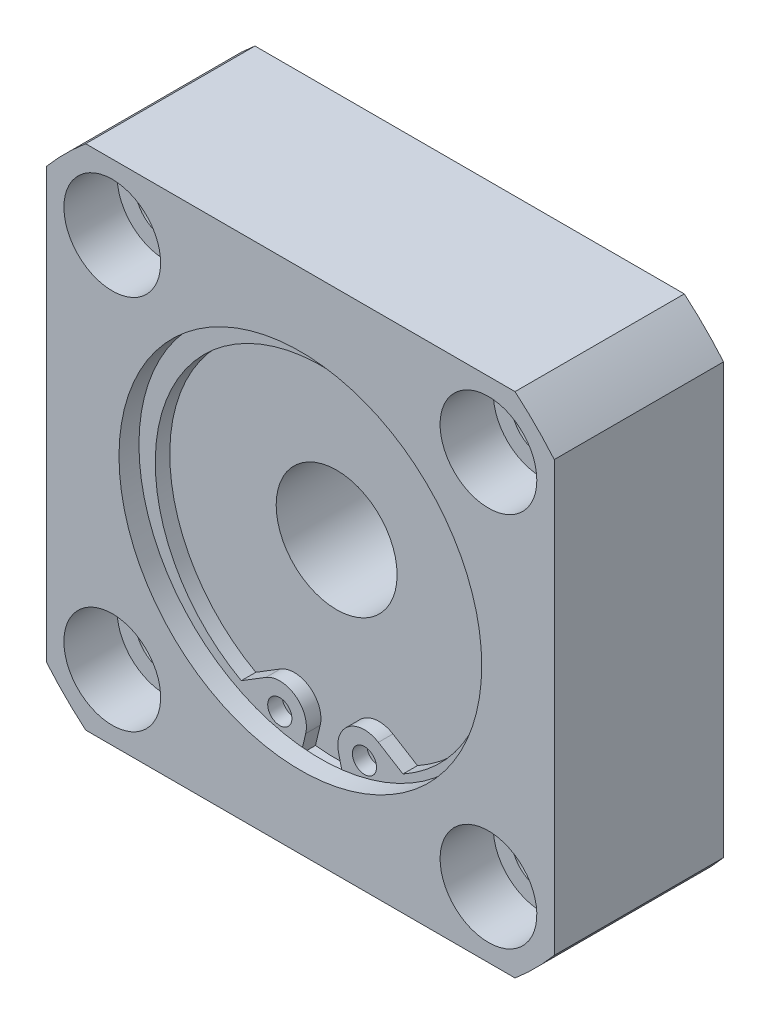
ISO-10303-21;
HEADER;
FILE_DESCRIPTION(('STEP AP214'),'2;1');
FILE_NAME('part.step','',(''),(''),'','','');
FILE_SCHEMA(('AUTOMOTIVE_DESIGN { 1 0 10303 214 1 1 1 1 }'));
ENDSEC;
DATA;
#1=APPLICATION_CONTEXT('core data for automotive mechanical design processes');
#2=APPLICATION_PROTOCOL_DEFINITION('international standard','automotive_design',2000,#1);
#3=PRODUCT_CONTEXT('',#1,'mechanical');
#4=PRODUCT('Part','Part','',(#3));
#5=PRODUCT_RELATED_PRODUCT_CATEGORY('part','',(#4));
#6=PRODUCT_DEFINITION_FORMATION('','',#4);
#7=PRODUCT_DEFINITION_CONTEXT('part definition',#1,'design');
#8=PRODUCT_DEFINITION('design','',#6,#7);
#9=PRODUCT_DEFINITION_SHAPE('','',#8);
#10=(LENGTH_UNIT() NAMED_UNIT(*) SI_UNIT(.MILLI.,.METRE.));
#11=(NAMED_UNIT(*) PLANE_ANGLE_UNIT() SI_UNIT($,.RADIAN.));
#12=(NAMED_UNIT(*) SI_UNIT($,.STERADIAN.) SOLID_ANGLE_UNIT());
#13=UNCERTAINTY_MEASURE_WITH_UNIT(LENGTH_MEASURE(1.E-05),#10,'distance_accuracy_value','');
#14=(GEOMETRIC_REPRESENTATION_CONTEXT(3) GLOBAL_UNCERTAINTY_ASSIGNED_CONTEXT((#13)) GLOBAL_UNIT_ASSIGNED_CONTEXT((#10,
#11,#12)) REPRESENTATION_CONTEXT('',''));
#15=CARTESIAN_POINT('',(0.,0.,0.));
#16=DIRECTION('',(0.,0.,1.));
#17=DIRECTION('',(1.,0.,0.));
#18=AXIS2_PLACEMENT_3D('',#15,#16,#17);
#19=CARTESIAN_POINT('',(15.556349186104,15.5563491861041,0.));
#20=DIRECTION('',(0.,0.,1.));
#21=DIRECTION('',(1.,0.,0.));
#22=AXIS2_PLACEMENT_3D('',#19,#20,#21);
#23=CYLINDRICAL_SURFACE('',#22,2.5);
#24=CARTESIAN_POINT('',(15.556349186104,15.5563491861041,0.));
#25=DIRECTION('',(0.,0.,1.));
#26=DIRECTION('',(1.,0.,0.));
#27=AXIS2_PLACEMENT_3D('',#24,#25,#26);
#28=CIRCLE('',#27,2.5);
#29=CARTESIAN_POINT('',(18.056349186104,15.5563491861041,0.));
#30=VERTEX_POINT('',#29);
#31=EDGE_CURVE('E210',#30,#30,#28,.T.);
#32=ORIENTED_EDGE('',*,*,#31,.F.);
#33=EDGE_LOOP('',(#32));
#34=FACE_BOUND('',#33,.T.);
#35=CARTESIAN_POINT('',(15.556349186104,15.5563491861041,9.6));
#36=DIRECTION('',(0.,0.,1.));
#37=DIRECTION('',(1.,0.,0.));
#38=AXIS2_PLACEMENT_3D('',#35,#36,#37);
#39=CIRCLE('',#38,2.5);
#40=CARTESIAN_POINT('',(18.056349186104,15.5563491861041,9.6));
#41=VERTEX_POINT('',#40);
#42=EDGE_CURVE('E207',#41,#41,#39,.F.);
#43=ORIENTED_EDGE('',*,*,#42,.F.);
#44=EDGE_LOOP('',(#43));
#45=FACE_BOUND('',#44,.T.);
#46=ADVANCED_FACE('F14',(#34,#45),#23,.F.);
#47=CARTESIAN_POINT('',(15.556349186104,-15.556349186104,0.));
#48=DIRECTION('',(0.,0.,1.));
#49=DIRECTION('',(1.,0.,0.));
#50=AXIS2_PLACEMENT_3D('',#47,#48,#49);
#51=CYLINDRICAL_SURFACE('',#50,2.5);
#52=CARTESIAN_POINT('',(15.556349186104,-15.556349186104,0.));
#53=DIRECTION('',(0.,0.,1.));
#54=DIRECTION('',(0.,-1.,0.));
#55=AXIS2_PLACEMENT_3D('',#52,#53,#54);
#56=CIRCLE('',#55,2.5);
#57=CARTESIAN_POINT('',(15.556349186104,-18.056349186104,0.));
#58=VERTEX_POINT('',#57);
#59=EDGE_CURVE('E290',#58,#58,#56,.T.);
#60=ORIENTED_EDGE('',*,*,#59,.F.);
#61=EDGE_LOOP('',(#60));
#62=FACE_BOUND('',#61,.T.);
#63=CARTESIAN_POINT('',(15.556349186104,-15.556349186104,9.6));
#64=DIRECTION('',(0.,0.,1.));
#65=DIRECTION('',(1.,0.,0.));
#66=AXIS2_PLACEMENT_3D('',#63,#64,#65);
#67=CIRCLE('',#66,2.5);
#68=CARTESIAN_POINT('',(18.056349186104,-15.556349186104,9.6));
#69=VERTEX_POINT('',#68);
#70=EDGE_CURVE('E202',#69,#69,#67,.F.);
#71=ORIENTED_EDGE('',*,*,#70,.F.);
#72=EDGE_LOOP('',(#71));
#73=FACE_BOUND('',#72,.T.);
#74=ADVANCED_FACE('F429',(#62,#73),#51,.F.);
#75=CARTESIAN_POINT('',(-15.5563491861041,-15.556349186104,0.));
#76=DIRECTION('',(0.,0.,1.));
#77=DIRECTION('',(1.,0.,0.));
#78=AXIS2_PLACEMENT_3D('',#75,#76,#77);
#79=CYLINDRICAL_SURFACE('',#78,2.5);
#80=CARTESIAN_POINT('',(-15.5563491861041,-15.556349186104,0.));
#81=DIRECTION('',(0.,0.,1.));
#82=DIRECTION('',(-1.,0.,0.));
#83=AXIS2_PLACEMENT_3D('',#80,#81,#82);
#84=CIRCLE('',#83,2.5);
#85=CARTESIAN_POINT('',(-18.0563491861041,-15.556349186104,0.));
#86=VERTEX_POINT('',#85);
#87=EDGE_CURVE('E293',#86,#86,#84,.T.);
#88=ORIENTED_EDGE('',*,*,#87,.F.);
#89=EDGE_LOOP('',(#88));
#90=FACE_BOUND('',#89,.T.);
#91=CARTESIAN_POINT('',(-15.5563491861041,-15.556349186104,9.6));
#92=DIRECTION('',(0.,0.,1.));
#93=DIRECTION('',(1.,0.,0.));
#94=AXIS2_PLACEMENT_3D('',#91,#92,#93);
#95=CIRCLE('',#94,2.5);
#96=CARTESIAN_POINT('',(-13.0563491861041,-15.556349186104,9.6));
#97=VERTEX_POINT('',#96);
#98=EDGE_CURVE('E197',#97,#97,#95,.F.);
#99=ORIENTED_EDGE('',*,*,#98,.F.);
#100=EDGE_LOOP('',(#99));
#101=FACE_BOUND('',#100,.T.);
#102=ADVANCED_FACE('F435',(#90,#101),#79,.F.);
#103=CARTESIAN_POINT('',(-15.556349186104,15.5563491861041,0.));
#104=DIRECTION('',(0.,0.,1.));
#105=DIRECTION('',(1.,0.,0.));
#106=AXIS2_PLACEMENT_3D('',#103,#104,#105);
#107=CYLINDRICAL_SURFACE('',#106,2.5);
#108=CARTESIAN_POINT('',(-15.556349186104,15.5563491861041,0.));
#109=DIRECTION('',(0.,0.,1.));
#110=DIRECTION('',(0.,1.,0.));
#111=AXIS2_PLACEMENT_3D('',#108,#109,#110);
#112=CIRCLE('',#111,2.5);
#113=CARTESIAN_POINT('',(-15.5563491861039,18.0563491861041,0.));
#114=VERTEX_POINT('',#113);
#115=EDGE_CURVE('E205',#114,#114,#112,.T.);
#116=ORIENTED_EDGE('',*,*,#115,.F.);
#117=EDGE_LOOP('',(#116));
#118=FACE_BOUND('',#117,.T.);
#119=CARTESIAN_POINT('',(-15.556349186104,15.5563491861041,9.6));
#120=DIRECTION('',(0.,0.,1.));
#121=DIRECTION('',(1.,0.,0.));
#122=AXIS2_PLACEMENT_3D('',#119,#120,#121);
#123=CIRCLE('',#122,2.5);
#124=CARTESIAN_POINT('',(-13.056349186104,15.5563491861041,9.6));
#125=VERTEX_POINT('',#124);
#126=EDGE_CURVE('E192',#125,#125,#123,.F.);
#127=ORIENTED_EDGE('',*,*,#126,.F.);
#128=EDGE_LOOP('',(#127));
#129=FACE_BOUND('',#128,.T.);
#130=ADVANCED_FACE('F539',(#118,#129),#107,.F.);
#131=CARTESIAN_POINT('',(15.556349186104,15.5563491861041,9.6));
#132=DIRECTION('',(0.,0.,1.));
#133=DIRECTION('',(1.,0.,0.));
#134=AXIS2_PLACEMENT_3D('',#131,#132,#133);
#135=PLANE('',#134);
#136=CARTESIAN_POINT('',(15.556349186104,15.5563491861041,9.6));
#137=DIRECTION('',(0.,0.,1.));
#138=DIRECTION('',(1.,0.,0.));
#139=AXIS2_PLACEMENT_3D('',#136,#137,#138);
#140=CIRCLE('',#139,4.);
#141=CARTESIAN_POINT('',(19.556349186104,15.5563491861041,9.6));
#142=VERTEX_POINT('',#141);
#143=EDGE_CURVE('E211',#142,#142,#140,.T.);
#144=ORIENTED_EDGE('',*,*,#143,.T.);
#145=EDGE_LOOP('',(#144));
#146=FACE_BOUND('',#145,.T.);
#147=ORIENTED_EDGE('',*,*,#42,.T.);
#148=EDGE_LOOP('',(#147));
#149=FACE_BOUND('',#148,.T.);
#150=ADVANCED_FACE('F534',(#146,#149),#135,.T.);
#151=CARTESIAN_POINT('',(15.556349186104,-15.556349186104,9.6));
#152=DIRECTION('',(0.,0.,1.));
#153=DIRECTION('',(0.,-1.,0.));
#154=AXIS2_PLACEMENT_3D('',#151,#152,#153);
#155=PLANE('',#154);
#156=CARTESIAN_POINT('',(15.556349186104,-15.556349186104,9.6));
#157=DIRECTION('',(0.,0.,1.));
#158=DIRECTION('',(0.,-1.,0.));
#159=AXIS2_PLACEMENT_3D('',#156,#157,#158);
#160=CIRCLE('',#159,4.);
#161=CARTESIAN_POINT('',(15.556349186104,-19.556349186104,9.6));
#162=VERTEX_POINT('',#161);
#163=EDGE_CURVE('E206',#162,#162,#160,.T.);
#164=ORIENTED_EDGE('',*,*,#163,.T.);
#165=EDGE_LOOP('',(#164));
#166=FACE_BOUND('',#165,.T.);
#167=ORIENTED_EDGE('',*,*,#70,.T.);
#168=EDGE_LOOP('',(#167));
#169=FACE_BOUND('',#168,.T.);
#170=ADVANCED_FACE('F526',(#166,#169),#155,.T.);
#171=CARTESIAN_POINT('',(-15.5563491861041,-15.556349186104,9.6));
#172=DIRECTION('',(0.,0.,1.));
#173=DIRECTION('',(-1.,0.,0.));
#174=AXIS2_PLACEMENT_3D('',#171,#172,#173);
#175=PLANE('',#174);
#176=CARTESIAN_POINT('',(-15.5563491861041,-15.556349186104,9.6));
#177=DIRECTION('',(0.,0.,1.));
#178=DIRECTION('',(-1.,0.,0.));
#179=AXIS2_PLACEMENT_3D('',#176,#177,#178);
#180=CIRCLE('',#179,4.);
#181=CARTESIAN_POINT('',(-19.5563491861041,-15.556349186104,9.6));
#182=VERTEX_POINT('',#181);
#183=EDGE_CURVE('E201',#182,#182,#180,.T.);
#184=ORIENTED_EDGE('',*,*,#183,.T.);
#185=EDGE_LOOP('',(#184));
#186=FACE_BOUND('',#185,.T.);
#187=ORIENTED_EDGE('',*,*,#98,.T.);
#188=EDGE_LOOP('',(#187));
#189=FACE_BOUND('',#188,.T.);
#190=ADVANCED_FACE('F518',(#186,#189),#175,.T.);
#191=CARTESIAN_POINT('',(-15.556349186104,15.5563491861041,9.6));
#192=DIRECTION('',(0.,0.,1.));
#193=DIRECTION('',(0.,1.,0.));
#194=AXIS2_PLACEMENT_3D('',#191,#192,#193);
#195=PLANE('',#194);
#196=CARTESIAN_POINT('',(-15.556349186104,15.5563491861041,9.6));
#197=DIRECTION('',(0.,0.,1.));
#198=DIRECTION('',(0.,1.,0.));
#199=AXIS2_PLACEMENT_3D('',#196,#197,#198);
#200=CIRCLE('',#199,4.);
#201=CARTESIAN_POINT('',(-15.5563491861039,19.5563491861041,9.6));
#202=VERTEX_POINT('',#201);
#203=EDGE_CURVE('E196',#202,#202,#200,.T.);
#204=ORIENTED_EDGE('',*,*,#203,.T.);
#205=EDGE_LOOP('',(#204));
#206=FACE_BOUND('',#205,.T.);
#207=ORIENTED_EDGE('',*,*,#126,.T.);
#208=EDGE_LOOP('',(#207));
#209=FACE_BOUND('',#208,.T.);
#210=ADVANCED_FACE('F450',(#206,#209),#195,.T.);
#211=CARTESIAN_POINT('',(0.,0.,0.));
#212=DIRECTION('',(0.,0.,-1.));
#213=DIRECTION('',(-1.,0.,0.));
#214=AXIS2_PLACEMENT_3D('',#211,#212,#213);
#215=PLANE('',#214);
#216=CARTESIAN_POINT('',(0.,0.,0.));
#217=DIRECTION('',(0.,0.,-1.));
#218=DIRECTION('',(-1.,0.,0.));
#219=AXIS2_PLACEMENT_3D('',#216,#217,#218);
#220=CIRCLE('',#219,12.);
#221=CARTESIAN_POINT('',(-12.,0.,0.));
#222=VERTEX_POINT('',#221);
#223=EDGE_CURVE('E181',#222,#222,#220,.T.);
#224=ORIENTED_EDGE('',*,*,#223,.F.);
#225=EDGE_LOOP('',(#224));
#226=FACE_BOUND('',#225,.T.);
#227=ORIENTED_EDGE('',*,*,#115,.T.);
#228=EDGE_LOOP('',(#227));
#229=FACE_BOUND('',#228,.T.);
#230=ORIENTED_EDGE('',*,*,#87,.T.);
#231=EDGE_LOOP('',(#230));
#232=FACE_BOUND('',#231,.T.);
#233=ORIENTED_EDGE('',*,*,#59,.T.);
#234=EDGE_LOOP('',(#233));
#235=FACE_BOUND('',#234,.T.);
#236=ORIENTED_EDGE('',*,*,#31,.T.);
#237=EDGE_LOOP('',(#236));
#238=FACE_BOUND('',#237,.T.);
#239=CARTESIAN_POINT('',(0.,0.,0.));
#240=DIRECTION('',(0.,0.,-1.));
#241=DIRECTION('',(-1.,0.,0.));
#242=AXIS2_PLACEMENT_3D('',#239,#240,#241);
#243=CIRCLE('',#242,27.5);
#244=CARTESIAN_POINT('',(21.,-17.7552809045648,0.));
#245=VERTEX_POINT('',#244);
#246=CARTESIAN_POINT('',(17.7552809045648,-21.,0.));
#247=VERTEX_POINT('',#246);
#248=EDGE_CURVE('E280',#245,#247,#243,.T.);
#249=ORIENTED_EDGE('',*,*,#248,.T.);
#250=DIRECTION('',(1.,0.,0.));
#251=VECTOR('',#250,1.);
#252=CARTESIAN_POINT('',(-17.7552809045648,-21.,0.));
#253=LINE('',#252,#251);
#254=CARTESIAN_POINT('',(-17.7552809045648,-21.,0.));
#255=VERTEX_POINT('',#254);
#256=EDGE_CURVE('E277',#255,#247,#253,.T.);
#257=ORIENTED_EDGE('',*,*,#256,.F.);
#258=CARTESIAN_POINT('',(0.,0.,0.));
#259=DIRECTION('',(0.,0.,1.));
#260=DIRECTION('',(1.,0.,0.));
#261=AXIS2_PLACEMENT_3D('',#258,#259,#260);
#262=CIRCLE('',#261,27.5);
#263=CARTESIAN_POINT('',(-21.,-17.7552809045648,0.));
#264=VERTEX_POINT('',#263);
#265=EDGE_CURVE('E274',#264,#255,#262,.T.);
#266=ORIENTED_EDGE('',*,*,#265,.F.);
#267=DIRECTION('',(0.,1.,0.));
#268=VECTOR('',#267,1.);
#269=CARTESIAN_POINT('',(-21.,-17.7552809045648,0.));
#270=LINE('',#269,#268);
#271=CARTESIAN_POINT('',(-21.,17.7552809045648,0.));
#272=VERTEX_POINT('',#271);
#273=EDGE_CURVE('E271',#264,#272,#270,.T.);
#274=ORIENTED_EDGE('',*,*,#273,.T.);
#275=CARTESIAN_POINT('',(0.,0.,0.));
#276=DIRECTION('',(0.,0.,-1.));
#277=DIRECTION('',(-1.,0.,0.));
#278=AXIS2_PLACEMENT_3D('',#275,#276,#277);
#279=CIRCLE('',#278,27.5);
#280=CARTESIAN_POINT('',(-17.7552809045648,21.,0.));
#281=VERTEX_POINT('',#280);
#282=EDGE_CURVE('E268',#272,#281,#279,.T.);
#283=ORIENTED_EDGE('',*,*,#282,.T.);
#284=DIRECTION('',(1.,0.,0.));
#285=VECTOR('',#284,1.);
#286=CARTESIAN_POINT('',(-17.7552809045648,21.,0.));
#287=LINE('',#286,#285);
#288=CARTESIAN_POINT('',(17.7552809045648,21.,0.));
#289=VERTEX_POINT('',#288);
#290=EDGE_CURVE('E265',#281,#289,#287,.T.);
#291=ORIENTED_EDGE('',*,*,#290,.T.);
#292=CARTESIAN_POINT('',(0.,0.,0.));
#293=DIRECTION('',(0.,0.,1.));
#294=DIRECTION('',(1.,0.,0.));
#295=AXIS2_PLACEMENT_3D('',#292,#293,#294);
#296=CIRCLE('',#295,27.5);
#297=CARTESIAN_POINT('',(21.,17.7552809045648,0.));
#298=VERTEX_POINT('',#297);
#299=EDGE_CURVE('E262',#298,#289,#296,.T.);
#300=ORIENTED_EDGE('',*,*,#299,.F.);
#301=DIRECTION('',(0.,1.,0.));
#302=VECTOR('',#301,1.);
#303=CARTESIAN_POINT('',(21.,-17.7552809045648,0.));
#304=LINE('',#303,#302);
#305=EDGE_CURVE('E259',#245,#298,#304,.T.);
#306=ORIENTED_EDGE('',*,*,#305,.F.);
#307=EDGE_LOOP('',(#249,#257,#266,#274,#283,#291,#300,#306));
#308=FACE_BOUND('',#307,.T.);
#309=ADVANCED_FACE('F447',(#226,#229,#232,#235,#238,#308),#215,.T.);
#310=CARTESIAN_POINT('',(-17.7552809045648,-21.,14.));
#311=DIRECTION('',(0.,1.,0.));
#312=DIRECTION('',(0.,0.,1.));
#313=AXIS2_PLACEMENT_3D('',#310,#311,#312);
#314=PLANE('',#313);
#315=DIRECTION('',(1.,0.,0.));
#316=VECTOR('',#315,1.);
#317=CARTESIAN_POINT('',(-17.7552809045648,-21.,14.));
#318=LINE('',#317,#316);
#319=CARTESIAN_POINT('',(-17.7552809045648,-21.,14.));
#320=VERTEX_POINT('',#319);
#321=CARTESIAN_POINT('',(17.7552809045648,-21.,14.));
#322=VERTEX_POINT('',#321);
#323=EDGE_CURVE('E253',#320,#322,#318,.T.);
#324=ORIENTED_EDGE('',*,*,#323,.F.);
#325=DIRECTION('',(0.,0.,-1.));
#326=VECTOR('',#325,1.);
#327=CARTESIAN_POINT('',(-17.7552809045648,-21.,14.));
#328=LINE('',#327,#326);
#329=EDGE_CURVE('E229',#320,#255,#328,.T.);
#330=ORIENTED_EDGE('',*,*,#329,.T.);
#331=ORIENTED_EDGE('',*,*,#256,.T.);
#332=DIRECTION('',(0.,0.,-1.));
#333=VECTOR('',#332,1.);
#334=CARTESIAN_POINT('',(17.7552809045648,-21.,14.));
#335=LINE('',#334,#333);
#336=EDGE_CURVE('E232',#322,#247,#335,.T.);
#337=ORIENTED_EDGE('',*,*,#336,.F.);
#338=EDGE_LOOP('',(#324,#330,#331,#337));
#339=FACE_BOUND('',#338,.T.);
#340=ADVANCED_FACE('F449',(#339),#314,.F.);
#341=CARTESIAN_POINT('',(0.,0.,14.));
#342=DIRECTION('',(0.,0.,-1.));
#343=DIRECTION('',(-1.,0.,0.));
#344=AXIS2_PLACEMENT_3D('',#341,#342,#343);
#345=CYLINDRICAL_SURFACE('',#344,27.5);
#346=ORIENTED_EDGE('',*,*,#329,.F.);
#347=CARTESIAN_POINT('',(0.,0.,14.));
#348=DIRECTION('',(0.,0.,1.));
#349=DIRECTION('',(1.,0.,0.));
#350=AXIS2_PLACEMENT_3D('',#347,#348,#349);
#351=CIRCLE('',#350,27.5);
#352=CARTESIAN_POINT('',(-21.,-17.7552809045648,14.));
#353=VERTEX_POINT('',#352);
#354=EDGE_CURVE('E250',#353,#320,#351,.T.);
#355=ORIENTED_EDGE('',*,*,#354,.F.);
#356=DIRECTION('',(0.,0.,-1.));
#357=VECTOR('',#356,1.);
#358=CARTESIAN_POINT('',(-21.,-17.7552809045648,14.));
#359=LINE('',#358,#357);
#360=EDGE_CURVE('E226',#353,#264,#359,.T.);
#361=ORIENTED_EDGE('',*,*,#360,.T.);
#362=ORIENTED_EDGE('',*,*,#265,.T.);
#363=EDGE_LOOP('',(#346,#355,#361,#362));
#364=FACE_BOUND('',#363,.T.);
#365=ADVANCED_FACE('F458',(#364),#345,.T.);
#366=CARTESIAN_POINT('',(-21.,-17.7552809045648,14.));
#367=DIRECTION('',(-1.,0.,0.));
#368=DIRECTION('',(0.,0.,1.));
#369=AXIS2_PLACEMENT_3D('',#366,#367,#368);
#370=PLANE('',#369);
#371=ORIENTED_EDGE('',*,*,#360,.F.);
#372=DIRECTION('',(0.,1.,0.));
#373=VECTOR('',#372,1.);
#374=CARTESIAN_POINT('',(-21.,-17.7552809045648,14.));
#375=LINE('',#374,#373);
#376=CARTESIAN_POINT('',(-21.,17.7552809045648,14.));
#377=VERTEX_POINT('',#376);
#378=EDGE_CURVE('E247',#353,#377,#375,.T.);
#379=ORIENTED_EDGE('',*,*,#378,.T.);
#380=DIRECTION('',(0.,0.,-1.));
#381=VECTOR('',#380,1.);
#382=CARTESIAN_POINT('',(-21.,17.7552809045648,14.));
#383=LINE('',#382,#381);
#384=EDGE_CURVE('E223',#377,#272,#383,.T.);
#385=ORIENTED_EDGE('',*,*,#384,.T.);
#386=ORIENTED_EDGE('',*,*,#273,.F.);
#387=EDGE_LOOP('',(#371,#379,#385,#386));
#388=FACE_BOUND('',#387,.T.);
#389=ADVANCED_FACE('F462',(#388),#370,.T.);
#390=CARTESIAN_POINT('',(0.,0.,14.));
#391=DIRECTION('',(0.,0.,-1.));
#392=DIRECTION('',(-1.,0.,0.));
#393=AXIS2_PLACEMENT_3D('',#390,#391,#392);
#394=CYLINDRICAL_SURFACE('',#393,27.5);
#395=ORIENTED_EDGE('',*,*,#384,.F.);
#396=CARTESIAN_POINT('',(0.,0.,14.));
#397=DIRECTION('',(0.,0.,-1.));
#398=DIRECTION('',(-1.,0.,0.));
#399=AXIS2_PLACEMENT_3D('',#396,#397,#398);
#400=CIRCLE('',#399,27.5);
#401=CARTESIAN_POINT('',(-17.7552809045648,21.,14.));
#402=VERTEX_POINT('',#401);
#403=EDGE_CURVE('E244',#377,#402,#400,.T.);
#404=ORIENTED_EDGE('',*,*,#403,.T.);
#405=DIRECTION('',(0.,0.,-1.));
#406=VECTOR('',#405,1.);
#407=CARTESIAN_POINT('',(-17.7552809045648,21.,14.));
#408=LINE('',#407,#406);
#409=EDGE_CURVE('E220',#402,#281,#408,.T.);
#410=ORIENTED_EDGE('',*,*,#409,.T.);
#411=ORIENTED_EDGE('',*,*,#282,.F.);
#412=EDGE_LOOP('',(#395,#404,#410,#411));
#413=FACE_BOUND('',#412,.T.);
#414=ADVANCED_FACE('F466',(#413),#394,.T.);
#415=CARTESIAN_POINT('',(-17.7552809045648,21.,14.));
#416=DIRECTION('',(0.,1.,0.));
#417=DIRECTION('',(0.,0.,1.));
#418=AXIS2_PLACEMENT_3D('',#415,#416,#417);
#419=PLANE('',#418);
#420=ORIENTED_EDGE('',*,*,#409,.F.);
#421=DIRECTION('',(1.,0.,0.));
#422=VECTOR('',#421,1.);
#423=CARTESIAN_POINT('',(-17.7552809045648,21.,14.));
#424=LINE('',#423,#422);
#425=CARTESIAN_POINT('',(17.7552809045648,21.,14.));
#426=VERTEX_POINT('',#425);
#427=EDGE_CURVE('E241',#402,#426,#424,.T.);
#428=ORIENTED_EDGE('',*,*,#427,.T.);
#429=DIRECTION('',(0.,0.,-1.));
#430=VECTOR('',#429,1.);
#431=CARTESIAN_POINT('',(17.7552809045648,21.,14.));
#432=LINE('',#431,#430);
#433=EDGE_CURVE('E217',#426,#289,#432,.T.);
#434=ORIENTED_EDGE('',*,*,#433,.T.);
#435=ORIENTED_EDGE('',*,*,#290,.F.);
#436=EDGE_LOOP('',(#420,#428,#434,#435));
#437=FACE_BOUND('',#436,.T.);
#438=ADVANCED_FACE('F470',(#437),#419,.T.);
#439=CARTESIAN_POINT('',(0.,0.,14.));
#440=DIRECTION('',(0.,0.,-1.));
#441=DIRECTION('',(-1.,0.,0.));
#442=AXIS2_PLACEMENT_3D('',#439,#440,#441);
#443=CYLINDRICAL_SURFACE('',#442,27.5);
#444=ORIENTED_EDGE('',*,*,#433,.F.);
#445=CARTESIAN_POINT('',(0.,0.,14.));
#446=DIRECTION('',(0.,0.,1.));
#447=DIRECTION('',(1.,0.,0.));
#448=AXIS2_PLACEMENT_3D('',#445,#446,#447);
#449=CIRCLE('',#448,27.5);
#450=CARTESIAN_POINT('',(21.,17.7552809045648,14.));
#451=VERTEX_POINT('',#450);
#452=EDGE_CURVE('E238',#451,#426,#449,.T.);
#453=ORIENTED_EDGE('',*,*,#452,.F.);
#454=DIRECTION('',(0.,0.,-1.));
#455=VECTOR('',#454,1.);
#456=CARTESIAN_POINT('',(21.,17.7552809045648,14.));
#457=LINE('',#456,#455);
#458=EDGE_CURVE('E214',#451,#298,#457,.T.);
#459=ORIENTED_EDGE('',*,*,#458,.T.);
#460=ORIENTED_EDGE('',*,*,#299,.T.);
#461=EDGE_LOOP('',(#444,#453,#459,#460));
#462=FACE_BOUND('',#461,.T.);
#463=ADVANCED_FACE('F375',(#462),#443,.T.);
#464=CARTESIAN_POINT('',(21.,-17.7552809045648,14.));
#465=DIRECTION('',(-1.,0.,0.));
#466=DIRECTION('',(0.,0.,1.));
#467=AXIS2_PLACEMENT_3D('',#464,#465,#466);
#468=PLANE('',#467);
#469=ORIENTED_EDGE('',*,*,#458,.F.);
#470=DIRECTION('',(0.,1.,0.));
#471=VECTOR('',#470,1.);
#472=CARTESIAN_POINT('',(21.,-17.7552809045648,14.));
#473=LINE('',#472,#471);
#474=CARTESIAN_POINT('',(21.,-17.7552809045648,14.));
#475=VERTEX_POINT('',#474);
#476=EDGE_CURVE('E235',#475,#451,#473,.T.);
#477=ORIENTED_EDGE('',*,*,#476,.F.);
#478=DIRECTION('',(0.,0.,-1.));
#479=VECTOR('',#478,1.);
#480=CARTESIAN_POINT('',(21.,-17.7552809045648,14.));
#481=LINE('',#480,#479);
#482=EDGE_CURVE('E177',#475,#245,#481,.T.);
#483=ORIENTED_EDGE('',*,*,#482,.T.);
#484=ORIENTED_EDGE('',*,*,#305,.T.);
#485=EDGE_LOOP('',(#469,#477,#483,#484));
#486=FACE_BOUND('',#485,.T.);
#487=ADVANCED_FACE('F364',(#486),#468,.F.);
#488=CARTESIAN_POINT('',(0.,0.,14.));
#489=DIRECTION('',(0.,0.,-1.));
#490=DIRECTION('',(-1.,0.,0.));
#491=AXIS2_PLACEMENT_3D('',#488,#489,#490);
#492=CYLINDRICAL_SURFACE('',#491,27.5);
#493=ORIENTED_EDGE('',*,*,#482,.F.);
#494=CARTESIAN_POINT('',(0.,0.,14.));
#495=DIRECTION('',(0.,0.,-1.));
#496=DIRECTION('',(-1.,0.,0.));
#497=AXIS2_PLACEMENT_3D('',#494,#495,#496);
#498=CIRCLE('',#497,27.5);
#499=EDGE_CURVE('E256',#475,#322,#498,.T.);
#500=ORIENTED_EDGE('',*,*,#499,.T.);
#501=ORIENTED_EDGE('',*,*,#336,.T.);
#502=ORIENTED_EDGE('',*,*,#248,.F.);
#503=EDGE_LOOP('',(#493,#500,#501,#502));
#504=FACE_BOUND('',#503,.T.);
#505=ADVANCED_FACE('F453',(#504),#492,.T.);
#506=CARTESIAN_POINT('',(15.556349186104,15.5563491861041,9.6));
#507=DIRECTION('',(0.,0.,1.));
#508=DIRECTION('',(1.,0.,0.));
#509=AXIS2_PLACEMENT_3D('',#506,#507,#508);
#510=CYLINDRICAL_SURFACE('',#509,4.);
#511=ORIENTED_EDGE('',*,*,#143,.F.);
#512=EDGE_LOOP('',(#511));
#513=FACE_BOUND('',#512,.T.);
#514=CARTESIAN_POINT('',(15.556349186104,15.5563491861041,14.));
#515=DIRECTION('',(0.,0.,1.));
#516=DIRECTION('',(1.,0.,0.));
#517=AXIS2_PLACEMENT_3D('',#514,#515,#516);
#518=CIRCLE('',#517,4.);
#519=CARTESIAN_POINT('',(19.556349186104,15.5563491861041,14.));
#520=VERTEX_POINT('',#519);
#521=EDGE_CURVE('E287',#520,#520,#518,.T.);
#522=ORIENTED_EDGE('',*,*,#521,.T.);
#523=EDGE_LOOP('',(#522));
#524=FACE_BOUND('',#523,.T.);
#525=ADVANCED_FACE('F442',(#513,#524),#510,.F.);
#526=CARTESIAN_POINT('',(15.556349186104,-15.556349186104,9.6));
#527=DIRECTION('',(0.,0.,1.));
#528=DIRECTION('',(1.,0.,0.));
#529=AXIS2_PLACEMENT_3D('',#526,#527,#528);
#530=CYLINDRICAL_SURFACE('',#529,4.);
#531=ORIENTED_EDGE('',*,*,#163,.F.);
#532=EDGE_LOOP('',(#531));
#533=FACE_BOUND('',#532,.T.);
#534=CARTESIAN_POINT('',(15.556349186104,-15.556349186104,14.));
#535=DIRECTION('',(0.,0.,1.));
#536=DIRECTION('',(0.,-1.,0.));
#537=AXIS2_PLACEMENT_3D('',#534,#535,#536);
#538=CIRCLE('',#537,4.);
#539=CARTESIAN_POINT('',(15.556349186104,-19.556349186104,14.));
#540=VERTEX_POINT('',#539);
#541=EDGE_CURVE('E200',#540,#540,#538,.T.);
#542=ORIENTED_EDGE('',*,*,#541,.T.);
#543=EDGE_LOOP('',(#542));
#544=FACE_BOUND('',#543,.T.);
#545=ADVANCED_FACE('F530',(#533,#544),#530,.F.);
#546=CARTESIAN_POINT('',(-15.5563491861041,-15.556349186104,9.6));
#547=DIRECTION('',(0.,0.,1.));
#548=DIRECTION('',(1.,0.,0.));
#549=AXIS2_PLACEMENT_3D('',#546,#547,#548);
#550=CYLINDRICAL_SURFACE('',#549,4.);
#551=ORIENTED_EDGE('',*,*,#183,.F.);
#552=EDGE_LOOP('',(#551));
#553=FACE_BOUND('',#552,.T.);
#554=CARTESIAN_POINT('',(-15.5563491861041,-15.556349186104,14.));
#555=DIRECTION('',(0.,0.,1.));
#556=DIRECTION('',(-1.,0.,0.));
#557=AXIS2_PLACEMENT_3D('',#554,#555,#556);
#558=CIRCLE('',#557,4.);
#559=CARTESIAN_POINT('',(-19.5563491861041,-15.556349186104,14.));
#560=VERTEX_POINT('',#559);
#561=EDGE_CURVE('E195',#560,#560,#558,.T.);
#562=ORIENTED_EDGE('',*,*,#561,.T.);
#563=EDGE_LOOP('',(#562));
#564=FACE_BOUND('',#563,.T.);
#565=ADVANCED_FACE('F522',(#553,#564),#550,.F.);
#566=CARTESIAN_POINT('',(-15.556349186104,15.5563491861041,9.6));
#567=DIRECTION('',(0.,0.,1.));
#568=DIRECTION('',(1.,0.,0.));
#569=AXIS2_PLACEMENT_3D('',#566,#567,#568);
#570=CYLINDRICAL_SURFACE('',#569,4.);
#571=ORIENTED_EDGE('',*,*,#203,.F.);
#572=EDGE_LOOP('',(#571));
#573=FACE_BOUND('',#572,.T.);
#574=CARTESIAN_POINT('',(-15.556349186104,15.5563491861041,14.));
#575=DIRECTION('',(0.,0.,1.));
#576=DIRECTION('',(0.,1.,0.));
#577=AXIS2_PLACEMENT_3D('',#574,#575,#576);
#578=CIRCLE('',#577,4.);
#579=CARTESIAN_POINT('',(-15.5563491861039,19.5563491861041,14.));
#580=VERTEX_POINT('',#579);
#581=EDGE_CURVE('E191',#580,#580,#578,.T.);
#582=ORIENTED_EDGE('',*,*,#581,.T.);
#583=EDGE_LOOP('',(#582));
#584=FACE_BOUND('',#583,.T.);
#585=ADVANCED_FACE('F511',(#573,#584),#570,.F.);
#586=CARTESIAN_POINT('',(0.,0.,2.));
#587=DIRECTION('',(0.,0.,-1.));
#588=DIRECTION('',(-1.,0.,0.));
#589=AXIS2_PLACEMENT_3D('',#586,#587,#588);
#590=CYLINDRICAL_SURFACE('',#589,12.);
#591=CARTESIAN_POINT('',(0.,0.,2.));
#592=DIRECTION('',(0.,0.,-1.));
#593=DIRECTION('',(-1.,0.,0.));
#594=AXIS2_PLACEMENT_3D('',#591,#592,#593);
#595=CIRCLE('',#594,12.);
#596=CARTESIAN_POINT('',(-12.,0.,2.));
#597=VERTEX_POINT('',#596);
#598=EDGE_CURVE('E187',#597,#597,#595,.T.);
#599=ORIENTED_EDGE('',*,*,#598,.F.);
#600=EDGE_LOOP('',(#599));
#601=FACE_BOUND('',#600,.T.);
#602=ORIENTED_EDGE('',*,*,#223,.T.);
#603=EDGE_LOOP('',(#602));
#604=FACE_BOUND('',#603,.T.);
#605=ADVANCED_FACE('F342',(#601,#604),#590,.F.);
#606=CARTESIAN_POINT('',(0.,0.,14.));
#607=DIRECTION('',(0.,0.,-1.));
#608=DIRECTION('',(-1.,0.,0.));
#609=AXIS2_PLACEMENT_3D('',#606,#607,#608);
#610=PLANE('',#609);
#611=CARTESIAN_POINT('',(0.,0.,14.));
#612=DIRECTION('',(0.,0.,1.));
#613=DIRECTION('',(1.,0.,0.));
#614=AXIS2_PLACEMENT_3D('',#611,#612,#613);
#615=CIRCLE('',#614,15.);
#616=CARTESIAN_POINT('',(15.,0.,14.));
#617=VERTEX_POINT('',#616);
#618=EDGE_CURVE('E186',#617,#617,#615,.T.);
#619=ORIENTED_EDGE('',*,*,#618,.F.);
#620=EDGE_LOOP('',(#619));
#621=FACE_BOUND('',#620,.T.);
#622=ORIENTED_EDGE('',*,*,#581,.F.);
#623=EDGE_LOOP('',(#622));
#624=FACE_BOUND('',#623,.T.);
#625=ORIENTED_EDGE('',*,*,#561,.F.);
#626=EDGE_LOOP('',(#625));
#627=FACE_BOUND('',#626,.T.);
#628=ORIENTED_EDGE('',*,*,#541,.F.);
#629=EDGE_LOOP('',(#628));
#630=FACE_BOUND('',#629,.T.);
#631=ORIENTED_EDGE('',*,*,#521,.F.);
#632=EDGE_LOOP('',(#631));
#633=FACE_BOUND('',#632,.T.);
#634=ORIENTED_EDGE('',*,*,#499,.F.);
#635=ORIENTED_EDGE('',*,*,#476,.T.);
#636=ORIENTED_EDGE('',*,*,#452,.T.);
#637=ORIENTED_EDGE('',*,*,#427,.F.);
#638=ORIENTED_EDGE('',*,*,#403,.F.);
#639=ORIENTED_EDGE('',*,*,#378,.F.);
#640=ORIENTED_EDGE('',*,*,#354,.T.);
#641=ORIENTED_EDGE('',*,*,#323,.T.);
#642=EDGE_LOOP('',(#634,#635,#636,#637,#638,#639,#640,#641));
#643=FACE_BOUND('',#642,.T.);
#644=ADVANCED_FACE('F339',(#621,#624,#627,#630,#633,#643),#610,.F.);
#645=CARTESIAN_POINT('',(0.,0.,2.));
#646=DIRECTION('',(0.,0.,-1.));
#647=DIRECTION('',(-1.,0.,0.));
#648=AXIS2_PLACEMENT_3D('',#645,#646,#647);
#649=PLANE('',#648);
#650=CARTESIAN_POINT('',(0.,0.,2.));
#651=DIRECTION('',(0.,0.,-1.));
#652=DIRECTION('',(-1.,0.,0.));
#653=AXIS2_PLACEMENT_3D('',#650,#651,#652);
#654=CIRCLE('',#653,5.);
#655=CARTESIAN_POINT('',(-5.,0.,2.));
#656=VERTEX_POINT('',#655);
#657=EDGE_CURVE('E183',#656,#656,#654,.T.);
#658=ORIENTED_EDGE('',*,*,#657,.F.);
#659=EDGE_LOOP('',(#658));
#660=FACE_BOUND('',#659,.T.);
#661=ORIENTED_EDGE('',*,*,#598,.T.);
#662=EDGE_LOOP('',(#661));
#663=FACE_BOUND('',#662,.T.);
#664=ADVANCED_FACE('F335',(#660,#663),#649,.T.);
#665=CARTESIAN_POINT('',(0.,0.,11.));
#666=DIRECTION('',(0.,0.,1.));
#667=DIRECTION('',(1.,0.,0.));
#668=AXIS2_PLACEMENT_3D('',#665,#666,#667);
#669=CYLINDRICAL_SURFACE('',#668,15.);
#670=CARTESIAN_POINT('',(0.,0.,12.35));
#671=DIRECTION('',(0.,0.,1.));
#672=DIRECTION('',(1.,0.,0.));
#673=AXIS2_PLACEMENT_3D('',#670,#671,#672);
#674=CIRCLE('',#673,15.);
#675=CARTESIAN_POINT('',(15.,0.,12.35));
#676=VERTEX_POINT('',#675);
#677=EDGE_CURVE('E178',#676,#676,#674,.F.);
#678=ORIENTED_EDGE('',*,*,#677,.T.);
#679=EDGE_LOOP('',(#678));
#680=FACE_BOUND('',#679,.T.);
#681=ORIENTED_EDGE('',*,*,#618,.T.);
#682=EDGE_LOOP('',(#681));
#683=FACE_BOUND('',#682,.T.);
#684=ADVANCED_FACE('F331',(#680,#683),#669,.F.);
#685=CARTESIAN_POINT('',(0.,0.,14.));
#686=DIRECTION('',(0.,0.,-1.));
#687=DIRECTION('',(-1.,0.,0.));
#688=AXIS2_PLACEMENT_3D('',#685,#686,#687);
#689=CYLINDRICAL_SURFACE('',#688,5.);
#690=CARTESIAN_POINT('',(0.,0.,11.));
#691=DIRECTION('',(0.,0.,1.));
#692=DIRECTION('',(1.,0.,0.));
#693=AXIS2_PLACEMENT_3D('',#690,#691,#692);
#694=CIRCLE('',#693,5.);
#695=CARTESIAN_POINT('',(5.,0.,11.));
#696=VERTEX_POINT('',#695);
#697=EDGE_CURVE('E188',#696,#696,#694,.T.);
#698=ORIENTED_EDGE('',*,*,#697,.T.);
#699=EDGE_LOOP('',(#698));
#700=FACE_BOUND('',#699,.T.);
#701=ORIENTED_EDGE('',*,*,#657,.T.);
#702=EDGE_LOOP('',(#701));
#703=FACE_BOUND('',#702,.T.);
#704=ADVANCED_FACE('F334',(#700,#703),#689,.F.);
#705=CARTESIAN_POINT('',(0.,0.,11.));
#706=DIRECTION('',(0.,0.,1.));
#707=DIRECTION('',(1.,0.,0.));
#708=AXIS2_PLACEMENT_3D('',#705,#706,#707);
#709=PLANE('',#708);
#710=ORIENTED_EDGE('',*,*,#697,.F.);
#711=EDGE_LOOP('',(#710));
#712=FACE_BOUND('',#711,.T.);
#713=CARTESIAN_POINT('',(0.,0.,11.));
#714=DIRECTION('',(0.,0.,1.));
#715=DIRECTION('',(1.,0.,0.));
#716=AXIS2_PLACEMENT_3D('',#713,#714,#715);
#717=CIRCLE('',#716,15.7);
#718=CARTESIAN_POINT('',(-1.7515909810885,-15.6019847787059,11.));
#719=VERTEX_POINT('',#718);
#720=CARTESIAN_POINT('',(1.75159098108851,-15.6019847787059,11.));
#721=VERTEX_POINT('',#720);
#722=EDGE_CURVE('E116',#719,#721,#717,.T.);
#723=ORIENTED_EDGE('',*,*,#722,.T.);
#724=DIRECTION('',(-0.231349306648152,0.972870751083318,0.));
#725=VECTOR('',#724,1.);
#726=CARTESIAN_POINT('',(-1.85374366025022,-0.440821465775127,11.));
#727=LINE('',#726,#725);
#728=CARTESIAN_POINT('',(1.35968434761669,-13.9539379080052,11.));
#729=VERTEX_POINT('',#728);
#730=EDGE_CURVE('E9',#721,#729,#727,.T.);
#731=ORIENTED_EDGE('',*,*,#730,.T.);
#732=CARTESIAN_POINT('',(3.5,-13.4449694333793,11.));
#733=DIRECTION('',(0.,0.,1.));
#734=DIRECTION('',(1.,0.,0.));
#735=AXIS2_PLACEMENT_3D('',#732,#733,#734);
#736=CIRCLE('',#735,2.2);
#737=CARTESIAN_POINT('',(4.6535366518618,-11.5716426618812,11.));
#738=VERTEX_POINT('',#737);
#739=EDGE_CURVE('E25',#738,#729,#736,.T.);
#740=ORIENTED_EDGE('',*,*,#739,.F.);
#741=DIRECTION('',(0.851512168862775,-0.524334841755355,0.));
#742=VECTOR('',#741,1.);
#743=CARTESIAN_POINT('',(-3.88709507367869,-6.31258595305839,11.));
#744=LINE('',#743,#742);
#745=CARTESIAN_POINT('',(6.68514847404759,-12.8226463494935,11.));
#746=VERTEX_POINT('',#745);
#747=EDGE_CURVE('E144',#738,#746,#744,.T.);
#748=ORIENTED_EDGE('',*,*,#747,.T.);
#749=CARTESIAN_POINT('',(0.,-0.75,11.));
#750=DIRECTION('',(0.,0.,1.));
#751=DIRECTION('',(1.,0.,0.));
#752=AXIS2_PLACEMENT_3D('',#749,#750,#751);
#753=CIRCLE('',#752,13.8);
#754=CARTESIAN_POINT('',(-6.68514847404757,-12.8226463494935,11.));
#755=VERTEX_POINT('',#754);
#756=EDGE_CURVE('E148',#746,#755,#753,.T.);
#757=ORIENTED_EDGE('',*,*,#756,.T.);
#758=DIRECTION('',(0.851512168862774,0.524334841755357,0.));
#759=VECTOR('',#758,1.);
#760=CARTESIAN_POINT('',(3.88709507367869,-6.31258595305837,11.));
#761=LINE('',#760,#759);
#762=CARTESIAN_POINT('',(-4.65353665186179,-11.5716426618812,11.));
#763=VERTEX_POINT('',#762);
#764=EDGE_CURVE('E152',#755,#763,#761,.T.);
#765=ORIENTED_EDGE('',*,*,#764,.T.);
#766=CARTESIAN_POINT('',(-3.5,-13.4449694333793,11.));
#767=DIRECTION('',(0.,0.,1.));
#768=DIRECTION('',(1.,0.,0.));
#769=AXIS2_PLACEMENT_3D('',#766,#767,#768);
#770=CIRCLE('',#769,2.2);
#771=CARTESIAN_POINT('',(-1.35968434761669,-13.9539379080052,11.));
#772=VERTEX_POINT('',#771);
#773=EDGE_CURVE('E159',#772,#763,#770,.T.);
#774=ORIENTED_EDGE('',*,*,#773,.F.);
#775=DIRECTION('',(-0.231349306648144,-0.97287075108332,0.));
#776=VECTOR('',#775,1.);
#777=CARTESIAN_POINT('',(1.85374366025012,-0.440821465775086,11.));
#778=LINE('',#777,#776);
#779=EDGE_CURVE('E156',#772,#719,#778,.T.);
#780=ORIENTED_EDGE('',*,*,#779,.T.);
#781=EDGE_LOOP('',(#723,#731,#740,#748,#757,#765,#774,#780));
#782=FACE_BOUND('',#781,.T.);
#783=ADVANCED_FACE('F327',(#712,#782),#709,.T.);
#784=CARTESIAN_POINT('',(0.,0.,12.35));
#785=DIRECTION('',(0.,0.,1.));
#786=DIRECTION('',(1.,0.,0.));
#787=AXIS2_PLACEMENT_3D('',#784,#785,#786);
#788=PLANE('',#787);
#789=CARTESIAN_POINT('',(0.,0.,12.35));
#790=DIRECTION('',(0.,0.,1.));
#791=DIRECTION('',(1.,0.,0.));
#792=AXIS2_PLACEMENT_3D('',#789,#790,#791);
#793=CIRCLE('',#792,15.7);
#794=CARTESIAN_POINT('',(15.7,0.,12.35));
#795=VERTEX_POINT('',#794);
#796=EDGE_CURVE('E182',#795,#795,#793,.T.);
#797=ORIENTED_EDGE('',*,*,#796,.F.);
#798=EDGE_LOOP('',(#797));
#799=FACE_BOUND('',#798,.T.);
#800=ORIENTED_EDGE('',*,*,#677,.F.);
#801=EDGE_LOOP('',(#800));
#802=FACE_BOUND('',#801,.T.);
#803=ADVANCED_FACE('F324',(#799,#802),#788,.F.);
#804=CARTESIAN_POINT('',(0.,0.,12.35));
#805=DIRECTION('',(0.,0.,-1.));
#806=DIRECTION('',(-1.,0.,0.));
#807=AXIS2_PLACEMENT_3D('',#804,#805,#806);
#808=CYLINDRICAL_SURFACE('',#807,15.7);
#809=ORIENTED_EDGE('',*,*,#796,.T.);
#810=EDGE_LOOP('',(#809));
#811=FACE_BOUND('',#810,.T.);
#812=CARTESIAN_POINT('',(0.,0.,12.2));
#813=DIRECTION('',(0.,0.,-1.));
#814=DIRECTION('',(-1.,0.,0.));
#815=AXIS2_PLACEMENT_3D('',#812,#813,#814);
#816=CIRCLE('',#815,15.7);
#817=CARTESIAN_POINT('',(-1.7515909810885,-15.6019847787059,12.2));
#818=VERTEX_POINT('',#817);
#819=CARTESIAN_POINT('',(1.75159098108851,-15.6019847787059,12.2));
#820=VERTEX_POINT('',#819);
#821=EDGE_CURVE('E172',#818,#820,#816,.T.);
#822=ORIENTED_EDGE('',*,*,#821,.T.);
#823=DIRECTION('',(0.,0.,-1.));
#824=VECTOR('',#823,1.);
#825=CARTESIAN_POINT('',(1.75159098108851,-15.6019847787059,12.35));
#826=LINE('',#825,#824);
#827=EDGE_CURVE('E74',#820,#721,#826,.T.);
#828=ORIENTED_EDGE('',*,*,#827,.T.);
#829=ORIENTED_EDGE('',*,*,#722,.F.);
#830=DIRECTION('',(0.,0.,-1.));
#831=VECTOR('',#830,1.);
#832=CARTESIAN_POINT('',(-1.7515909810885,-15.6019847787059,12.35));
#833=LINE('',#832,#831);
#834=EDGE_CURVE('E174',#719,#818,#833,.F.);
#835=ORIENTED_EDGE('',*,*,#834,.T.);
#836=EDGE_LOOP('',(#822,#828,#829,#835));
#837=FACE_BOUND('',#836,.T.);
#838=ADVANCED_FACE('F321',(#811,#837),#808,.F.);
#839=CARTESIAN_POINT('',(3.5,-13.4449694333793,11.));
#840=DIRECTION('',(0.,0.,1.));
#841=DIRECTION('',(1.,0.,0.));
#842=AXIS2_PLACEMENT_3D('',#839,#840,#841);
#843=CIRCLE('',#842,1.);
#844=CARTESIAN_POINT('',(4.5,-13.4449694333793,11.));
#845=VERTEX_POINT('',#844);
#846=EDGE_CURVE('E167',#845,#845,#843,.T.);
#847=ORIENTED_EDGE('',*,*,#846,.T.);
#848=EDGE_LOOP('',(#847));
#849=FACE_BOUND('',#848,.T.);
#850=ADVANCED_FACE('F422',(#849),#709,.T.);
#851=CARTESIAN_POINT('',(-3.5,-13.4449694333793,11.));
#852=DIRECTION('',(0.,0.,1.));
#853=DIRECTION('',(1.,0.,0.));
#854=AXIS2_PLACEMENT_3D('',#851,#852,#853);
#855=CIRCLE('',#854,1.);
#856=CARTESIAN_POINT('',(-2.5,-13.4449694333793,11.));
#857=VERTEX_POINT('',#856);
#858=EDGE_CURVE('E163',#857,#857,#855,.T.);
#859=ORIENTED_EDGE('',*,*,#858,.T.);
#860=EDGE_LOOP('',(#859));
#861=FACE_BOUND('',#860,.T.);
#862=ADVANCED_FACE('F413',(#861),#709,.T.);
#863=CARTESIAN_POINT('',(4.6535366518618,-11.5716426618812,12.2));
#864=DIRECTION('',(-0.524334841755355,-0.851512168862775,0.));
#865=DIRECTION('',(-0.851512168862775,0.524334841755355,0.));
#866=AXIS2_PLACEMENT_3D('',#863,#864,#865);
#867=PLANE('',#866);
#868=ORIENTED_EDGE('',*,*,#747,.F.);
#869=DIRECTION('',(0.,0.,-1.));
#870=VECTOR('',#869,1.);
#871=CARTESIAN_POINT('',(4.6535366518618,-11.5716426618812,12.2));
#872=LINE('',#871,#870);
#873=CARTESIAN_POINT('',(4.6535366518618,-11.5716426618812,12.2));
#874=VERTEX_POINT('',#873);
#875=EDGE_CURVE('E18',#874,#738,#872,.T.);
#876=ORIENTED_EDGE('',*,*,#875,.F.);
#877=DIRECTION('',(-0.851512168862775,0.524334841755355,0.));
#878=VECTOR('',#877,1.);
#879=CARTESIAN_POINT('',(4.6535366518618,-11.5716426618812,12.2));
#880=LINE('',#879,#878);
#881=CARTESIAN_POINT('',(6.68514847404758,-12.8226463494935,12.2));
#882=VERTEX_POINT('',#881);
#883=EDGE_CURVE('E86',#882,#874,#880,.T.);
#884=ORIENTED_EDGE('',*,*,#883,.F.);
#885=DIRECTION('',(0.,0.,-1.));
#886=VECTOR('',#885,1.);
#887=CARTESIAN_POINT('',(6.68514847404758,-12.8226463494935,12.2));
#888=LINE('',#887,#886);
#889=EDGE_CURVE('E107',#882,#746,#888,.T.);
#890=ORIENTED_EDGE('',*,*,#889,.T.);
#891=EDGE_LOOP('',(#868,#876,#884,#890));
#892=FACE_BOUND('',#891,.T.);
#893=ADVANCED_FACE('F411',(#892),#867,.F.);
#894=CARTESIAN_POINT('',(0.,-0.75,12.2));
#895=DIRECTION('',(0.,0.,1.));
#896=DIRECTION('',(-1.,0.,0.));
#897=AXIS2_PLACEMENT_3D('',#894,#895,#896);
#898=CYLINDRICAL_SURFACE('',#897,13.8);
#899=ORIENTED_EDGE('',*,*,#756,.F.);
#900=ORIENTED_EDGE('',*,*,#889,.F.);
#901=CARTESIAN_POINT('',(0.,-0.75,12.2));
#902=DIRECTION('',(0.,0.,-1.));
#903=DIRECTION('',(0.,-1.,0.));
#904=AXIS2_PLACEMENT_3D('',#901,#902,#903);
#905=CIRCLE('',#904,13.8);
#906=CARTESIAN_POINT('',(-6.68514847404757,-12.8226463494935,12.2));
#907=VERTEX_POINT('',#906);
#908=EDGE_CURVE('E102',#907,#882,#905,.T.);
#909=ORIENTED_EDGE('',*,*,#908,.F.);
#910=DIRECTION('',(0.,0.,-1.));
#911=VECTOR('',#910,1.);
#912=CARTESIAN_POINT('',(-6.68514847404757,-12.8226463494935,12.2));
#913=LINE('',#912,#911);
#914=EDGE_CURVE('E110',#907,#755,#913,.T.);
#915=ORIENTED_EDGE('',*,*,#914,.T.);
#916=EDGE_LOOP('',(#899,#900,#909,#915));
#917=FACE_BOUND('',#916,.T.);
#918=ADVANCED_FACE('F410',(#917),#898,.F.);
#919=CARTESIAN_POINT('',(-4.65353665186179,-11.5716426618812,12.2));
#920=DIRECTION('',(0.524334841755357,-0.851512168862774,0.));
#921=DIRECTION('',(0.,0.,-1.));
#922=AXIS2_PLACEMENT_3D('',#919,#920,#921);
#923=PLANE('',#922);
#924=ORIENTED_EDGE('',*,*,#764,.F.);
#925=ORIENTED_EDGE('',*,*,#914,.F.);
#926=DIRECTION('',(-0.851512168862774,-0.524334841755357,0.));
#927=VECTOR('',#926,1.);
#928=CARTESIAN_POINT('',(-4.65353665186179,-11.5716426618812,12.2));
#929=LINE('',#928,#927);
#930=CARTESIAN_POINT('',(-4.65353665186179,-11.5716426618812,12.2));
#931=VERTEX_POINT('',#930);
#932=EDGE_CURVE('E111',#931,#907,#929,.T.);
#933=ORIENTED_EDGE('',*,*,#932,.F.);
#934=DIRECTION('',(0.,0.,-1.));
#935=VECTOR('',#934,1.);
#936=CARTESIAN_POINT('',(-4.65353665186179,-11.5716426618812,12.2));
#937=LINE('',#936,#935);
#938=EDGE_CURVE('E113',#931,#763,#937,.T.);
#939=ORIENTED_EDGE('',*,*,#938,.T.);
#940=EDGE_LOOP('',(#924,#925,#933,#939));
#941=FACE_BOUND('',#940,.T.);
#942=ADVANCED_FACE('F420',(#941),#923,.F.);
#943=CARTESIAN_POINT('',(-3.5,-13.4449694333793,12.2));
#944=DIRECTION('',(0.,0.,1.));
#945=DIRECTION('',(-1.,0.,0.));
#946=AXIS2_PLACEMENT_3D('',#943,#944,#945);
#947=CYLINDRICAL_SURFACE('',#946,1.);
#948=ORIENTED_EDGE('',*,*,#858,.F.);
#949=EDGE_LOOP('',(#948));
#950=FACE_BOUND('',#949,.T.);
#951=CARTESIAN_POINT('',(-3.5,-13.4449694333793,12.2));
#952=DIRECTION('',(0.,0.,-1.));
#953=DIRECTION('',(1.,0.,0.));
#954=AXIS2_PLACEMENT_3D('',#951,#952,#953);
#955=CIRCLE('',#954,1.);
#956=CARTESIAN_POINT('',(-2.5,-13.4449694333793,12.2));
#957=VERTEX_POINT('',#956);
#958=EDGE_CURVE('E96',#957,#957,#955,.T.);
#959=ORIENTED_EDGE('',*,*,#958,.F.);
#960=EDGE_LOOP('',(#959));
#961=FACE_BOUND('',#960,.T.);
#962=ADVANCED_FACE('F479',(#950,#961),#947,.F.);
#963=CARTESIAN_POINT('',(3.5,-13.4449694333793,12.2));
#964=DIRECTION('',(0.,0.,1.));
#965=DIRECTION('',(-1.,0.,0.));
#966=AXIS2_PLACEMENT_3D('',#963,#964,#965);
#967=CYLINDRICAL_SURFACE('',#966,1.);
#968=ORIENTED_EDGE('',*,*,#846,.F.);
#969=EDGE_LOOP('',(#968));
#970=FACE_BOUND('',#969,.T.);
#971=CARTESIAN_POINT('',(3.5,-13.4449694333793,12.2));
#972=DIRECTION('',(0.,0.,1.));
#973=DIRECTION('',(1.,0.,0.));
#974=AXIS2_PLACEMENT_3D('',#971,#972,#973);
#975=CIRCLE('',#974,1.);
#976=CARTESIAN_POINT('',(4.5,-13.4449694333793,12.2));
#977=VERTEX_POINT('',#976);
#978=EDGE_CURVE('E98',#977,#977,#975,.T.);
#979=ORIENTED_EDGE('',*,*,#978,.T.);
#980=EDGE_LOOP('',(#979));
#981=FACE_BOUND('',#980,.T.);
#982=ADVANCED_FACE('F16',(#970,#981),#967,.F.);
#983=CARTESIAN_POINT('',(3.5,-13.4449694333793,12.2));
#984=DIRECTION('',(0.,0.,1.));
#985=DIRECTION('',(-1.,0.,0.));
#986=AXIS2_PLACEMENT_3D('',#983,#984,#985);
#987=CYLINDRICAL_SURFACE('',#986,2.2);
#988=ORIENTED_EDGE('',*,*,#739,.T.);
#989=DIRECTION('',(0.,0.,-1.));
#990=VECTOR('',#989,1.);
#991=CARTESIAN_POINT('',(1.35968434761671,-13.9539379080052,12.2));
#992=LINE('',#991,#990);
#993=CARTESIAN_POINT('',(1.35968434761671,-13.9539379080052,12.2));
#994=VERTEX_POINT('',#993);
#995=EDGE_CURVE('E71',#994,#729,#992,.T.);
#996=ORIENTED_EDGE('',*,*,#995,.F.);
#997=CARTESIAN_POINT('',(3.5,-13.4449694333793,12.2));
#998=DIRECTION('',(0.,0.,1.));
#999=DIRECTION('',(1.,0.,0.));
#1000=AXIS2_PLACEMENT_3D('',#997,#998,#999);
#1001=CIRCLE('',#1000,2.2);
#1002=EDGE_CURVE('E79',#874,#994,#1001,.T.);
#1003=ORIENTED_EDGE('',*,*,#1002,.F.);
#1004=ORIENTED_EDGE('',*,*,#875,.T.);
#1005=EDGE_LOOP('',(#988,#996,#1003,#1004));
#1006=FACE_BOUND('',#1005,.T.);
#1007=ADVANCED_FACE('F89',(#1006),#987,.T.);
#1008=CARTESIAN_POINT('',(0.,-0.75,12.2));
#1009=DIRECTION('',(0.,0.,-1.));
#1010=DIRECTION('',(0.,-1.,0.));
#1011=AXIS2_PLACEMENT_3D('',#1008,#1009,#1010);
#1012=PLANE('',#1011);
#1013=ORIENTED_EDGE('',*,*,#978,.F.);
#1014=EDGE_LOOP('',(#1013));
#1015=FACE_BOUND('',#1014,.T.);
#1016=ORIENTED_EDGE('',*,*,#958,.T.);
#1017=EDGE_LOOP('',(#1016));
#1018=FACE_BOUND('',#1017,.T.);
#1019=ORIENTED_EDGE('',*,*,#821,.F.);
#1020=DIRECTION('',(0.231349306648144,0.97287075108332,0.));
#1021=VECTOR('',#1020,1.);
#1022=CARTESIAN_POINT('',(-1.3596843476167,-13.9539379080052,12.2));
#1023=LINE('',#1022,#1021);
#1024=CARTESIAN_POINT('',(-1.3596843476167,-13.9539379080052,12.2));
#1025=VERTEX_POINT('',#1024);
#1026=EDGE_CURVE('E80',#818,#1025,#1023,.T.);
#1027=ORIENTED_EDGE('',*,*,#1026,.T.);
#1028=CARTESIAN_POINT('',(-3.5,-13.4449694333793,12.2));
#1029=DIRECTION('',(0.,0.,1.));
#1030=DIRECTION('',(-1.,0.,0.));
#1031=AXIS2_PLACEMENT_3D('',#1028,#1029,#1030);
#1032=CIRCLE('',#1031,2.2);
#1033=EDGE_CURVE('E118',#1025,#931,#1032,.T.);
#1034=ORIENTED_EDGE('',*,*,#1033,.T.);
#1035=ORIENTED_EDGE('',*,*,#932,.T.);
#1036=ORIENTED_EDGE('',*,*,#908,.T.);
#1037=ORIENTED_EDGE('',*,*,#883,.T.);
#1038=ORIENTED_EDGE('',*,*,#1002,.T.);
#1039=DIRECTION('',(0.231349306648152,-0.972870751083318,0.));
#1040=VECTOR('',#1039,1.);
#1041=CARTESIAN_POINT('',(1.35968434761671,-13.9539379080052,12.2));
#1042=LINE('',#1041,#1040);
#1043=EDGE_CURVE('E67',#994,#820,#1042,.T.);
#1044=ORIENTED_EDGE('',*,*,#1043,.T.);
#1045=EDGE_LOOP('',(#1019,#1027,#1034,#1035,#1036,#1037,#1038,#1044));
#1046=FACE_BOUND('',#1045,.T.);
#1047=ADVANCED_FACE('F84',(#1015,#1018,#1046),#1012,.F.);
#1048=CARTESIAN_POINT('',(-3.5,-13.4449694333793,12.2));
#1049=DIRECTION('',(0.,0.,1.));
#1050=DIRECTION('',(-1.,0.,0.));
#1051=AXIS2_PLACEMENT_3D('',#1048,#1049,#1050);
#1052=CYLINDRICAL_SURFACE('',#1051,2.2);
#1053=ORIENTED_EDGE('',*,*,#773,.T.);
#1054=ORIENTED_EDGE('',*,*,#938,.F.);
#1055=ORIENTED_EDGE('',*,*,#1033,.F.);
#1056=DIRECTION('',(0.,0.,-1.));
#1057=VECTOR('',#1056,1.);
#1058=CARTESIAN_POINT('',(-1.3596843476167,-13.9539379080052,12.2));
#1059=LINE('',#1058,#1057);
#1060=EDGE_CURVE('E91',#1025,#772,#1059,.T.);
#1061=ORIENTED_EDGE('',*,*,#1060,.T.);
#1062=EDGE_LOOP('',(#1053,#1054,#1055,#1061));
#1063=FACE_BOUND('',#1062,.T.);
#1064=ADVANCED_FACE('F482',(#1063),#1052,.T.);
#1065=CARTESIAN_POINT('',(-1.3596843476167,-13.9539379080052,12.2));
#1066=DIRECTION('',(-0.97287075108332,0.231349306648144,0.));
#1067=DIRECTION('',(0.,0.,1.));
#1068=AXIS2_PLACEMENT_3D('',#1065,#1066,#1067);
#1069=PLANE('',#1068);
#1070=ORIENTED_EDGE('',*,*,#834,.F.);
#1071=ORIENTED_EDGE('',*,*,#779,.F.);
#1072=ORIENTED_EDGE('',*,*,#1060,.F.);
#1073=ORIENTED_EDGE('',*,*,#1026,.F.);
#1074=EDGE_LOOP('',(#1070,#1071,#1072,#1073));
#1075=FACE_BOUND('',#1074,.T.);
#1076=ADVANCED_FACE('F487',(#1075),#1069,.F.);
#1077=CARTESIAN_POINT('',(1.35968434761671,-13.9539379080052,12.2));
#1078=DIRECTION('',(0.972870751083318,0.231349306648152,0.));
#1079=DIRECTION('',(0.,0.,-1.));
#1080=AXIS2_PLACEMENT_3D('',#1077,#1078,#1079);
#1081=PLANE('',#1080);
#1082=ORIENTED_EDGE('',*,*,#827,.F.);
#1083=ORIENTED_EDGE('',*,*,#1043,.F.);
#1084=ORIENTED_EDGE('',*,*,#995,.T.);
#1085=ORIENTED_EDGE('',*,*,#730,.F.);
#1086=EDGE_LOOP('',(#1082,#1083,#1084,#1085));
#1087=FACE_BOUND('',#1086,.T.);
#1088=ADVANCED_FACE('F69',(#1087),#1081,.F.);
#1089=CLOSED_SHELL('',(#46,#74,#102,#130,#150,#170,#190,#210,#309,#340,#365,#389,#414,#438,#463,
#487,#505,#525,#545,#565,#585,#605,#644,#664,#684,#704,#783,#803,#838,#850,#862,#893,#918,#942,
#962,#982,#1007,#1047,#1064,#1076,#1088));
#1090=MANIFOLD_SOLID_BREP('B1',#1089);
#1091=ADVANCED_BREP_SHAPE_REPRESENTATION('',(#18,#1090),#14);
#1092=SHAPE_DEFINITION_REPRESENTATION(#9,#1091);
ENDSEC;
END-ISO-10303-21;
